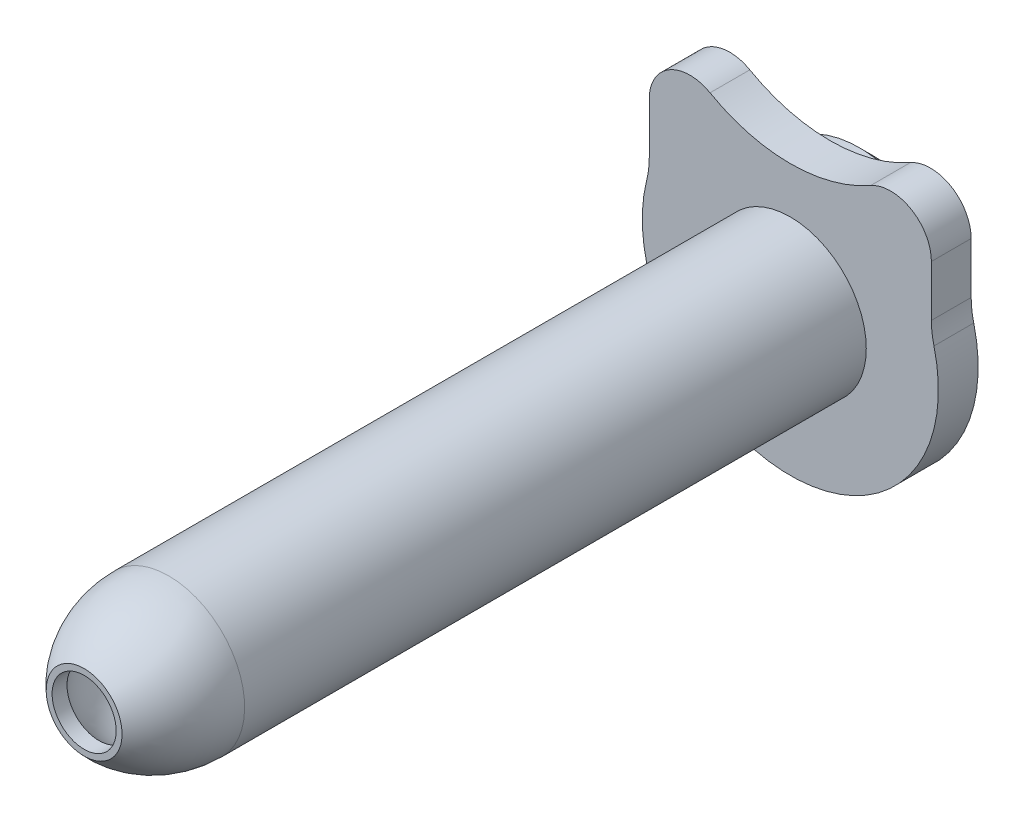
ISO-10303-21;
HEADER;
FILE_DESCRIPTION(('STEP AP214'),'2;1');
FILE_NAME('part.step','',(''),(''),'','','');
FILE_SCHEMA(('AUTOMOTIVE_DESIGN { 1 0 10303 214 1 1 1 1 }'));
ENDSEC;
DATA;
#1=APPLICATION_CONTEXT('core data for automotive mechanical design processes');
#2=APPLICATION_PROTOCOL_DEFINITION('international standard','automotive_design',2000,#1);
#3=PRODUCT_CONTEXT('',#1,'mechanical');
#4=PRODUCT('Part','Part','',(#3));
#5=PRODUCT_RELATED_PRODUCT_CATEGORY('part','',(#4));
#6=PRODUCT_DEFINITION_FORMATION('','',#4);
#7=PRODUCT_DEFINITION_CONTEXT('part definition',#1,'design');
#8=PRODUCT_DEFINITION('design','',#6,#7);
#9=PRODUCT_DEFINITION_SHAPE('','',#8);
#10=(LENGTH_UNIT() NAMED_UNIT(*) SI_UNIT(.MILLI.,.METRE.));
#11=(NAMED_UNIT(*) PLANE_ANGLE_UNIT() SI_UNIT($,.RADIAN.));
#12=(NAMED_UNIT(*) SI_UNIT($,.STERADIAN.) SOLID_ANGLE_UNIT());
#13=UNCERTAINTY_MEASURE_WITH_UNIT(LENGTH_MEASURE(1.E-05),#10,'distance_accuracy_value','');
#14=(GEOMETRIC_REPRESENTATION_CONTEXT(3) GLOBAL_UNCERTAINTY_ASSIGNED_CONTEXT((#13)) GLOBAL_UNIT_ASSIGNED_CONTEXT((#10,
#11,#12)) REPRESENTATION_CONTEXT('',''));
#15=CARTESIAN_POINT('',(0.,0.,0.));
#16=DIRECTION('',(0.,0.,1.));
#17=DIRECTION('',(1.,0.,0.));
#18=AXIS2_PLACEMENT_3D('',#15,#16,#17);
#19=CARTESIAN_POINT('',(0.,0.,39.5732));
#20=DIRECTION('',(0.,0.,-1.));
#21=DIRECTION('',(0.,1.,0.));
#22=AXIS2_PLACEMENT_3D('',#19,#20,#21);
#23=DEGENERATE_TOROIDAL_SURFACE('',#22,2.0828,5.5118,.F.);
#24=CARTESIAN_POINT('',(0.,0.,43.4848));
#25=DIRECTION('',(0.,0.,-1.));
#26=DIRECTION('',(0.,1.,0.));
#27=AXIS2_PLACEMENT_3D('',#24,#25,#26);
#28=CIRCLE('',#27,1.80041061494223);
#29=CARTESIAN_POINT('',(0.,1.80041061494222,43.4848));
#30=VERTEX_POINT('',#29);
#31=EDGE_CURVE('E159',#30,#30,#28,.T.);
#32=ORIENTED_EDGE('',*,*,#31,.F.);
#33=EDGE_LOOP('',(#32));
#34=FACE_BOUND('',#33,.T.);
#35=CARTESIAN_POINT('',(0.,0.,39.7002));
#36=DIRECTION('',(0.,0.,-1.));
#37=DIRECTION('',(0.,1.,0.));
#38=AXIS2_PLACEMENT_3D('',#35,#36,#37);
#39=CIRCLE('',#38,3.42753667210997);
#40=CARTESIAN_POINT('',(0.,3.42753667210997,39.7002));
#41=VERTEX_POINT('',#40);
#42=EDGE_CURVE('E34',#41,#41,#39,.F.);
#43=ORIENTED_EDGE('',*,*,#42,.F.);
#44=EDGE_LOOP('',(#43));
#45=FACE_BOUND('',#44,.T.);
#46=ADVANCED_FACE('F30',(#34,#45),#23,.T.);
#47=CARTESIAN_POINT('',(5.6388,6.05972488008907,2.413));
#48=DIRECTION('',(0.,0.,1.));
#49=DIRECTION('',(0.,-1.,0.));
#50=AXIS2_PLACEMENT_3D('',#47,#48,#49);
#51=PLANE('',#50);
#52=CARTESIAN_POINT('',(5.6388,6.05972488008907,2.413));
#53=DIRECTION('',(0.,0.,-1.));
#54=DIRECTION('',(0.,-1.,0.));
#55=AXIS2_PLACEMENT_3D('',#52,#53,#54);
#56=CIRCLE('',#55,2.286);
#57=CARTESIAN_POINT('',(4.51104,8.04817990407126,2.413));
#58=VERTEX_POINT('',#57);
#59=CARTESIAN_POINT('',(7.9248,6.05972488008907,2.413));
#60=VERTEX_POINT('',#59);
#61=EDGE_CURVE('E144',#58,#60,#56,.T.);
#62=ORIENTED_EDGE('',*,*,#61,.T.);
#63=DIRECTION('',(0.,-1.,0.));
#64=VECTOR('',#63,1.);
#65=CARTESIAN_POINT('',(7.9248,3.19295781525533,2.413));
#66=LINE('',#65,#64);
#67=CARTESIAN_POINT('',(7.9248,3.19295781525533,2.413));
#68=VERTEX_POINT('',#67);
#69=EDGE_CURVE('E92',#60,#68,#66,.T.);
#70=ORIENTED_EDGE('',*,*,#69,.T.);
#71=CARTESIAN_POINT('',(12.7508,3.19295781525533,2.413));
#72=DIRECTION('',(0.,0.,1.));
#73=DIRECTION('',(0.,-1.,0.));
#74=AXIS2_PLACEMENT_3D('',#71,#72,#73);
#75=CIRCLE('',#74,4.826);
#76=CARTESIAN_POINT('',(8.06934685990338,2.02066412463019,2.413));
#77=VERTEX_POINT('',#76);
#78=EDGE_CURVE('E405',#68,#77,#75,.T.);
#79=ORIENTED_EDGE('',*,*,#78,.T.);
#80=CARTESIAN_POINT('',(0.,0.,2.413));
#81=DIRECTION('',(0.,0.,-1.));
#82=DIRECTION('',(0.,1.,0.));
#83=AXIS2_PLACEMENT_3D('',#80,#81,#82);
#84=CIRCLE('',#83,8.3185);
#85=CARTESIAN_POINT('',(-8.06934685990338,2.02066412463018,2.413));
#86=VERTEX_POINT('',#85);
#87=EDGE_CURVE('E407',#77,#86,#84,.T.);
#88=ORIENTED_EDGE('',*,*,#87,.T.);
#89=CARTESIAN_POINT('',(-12.7508,3.19295781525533,2.413));
#90=DIRECTION('',(0.,0.,1.));
#91=DIRECTION('',(0.,-1.,0.));
#92=AXIS2_PLACEMENT_3D('',#89,#90,#91);
#93=CIRCLE('',#92,4.826);
#94=CARTESIAN_POINT('',(-7.9248,3.19295781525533,2.413));
#95=VERTEX_POINT('',#94);
#96=EDGE_CURVE('E112',#86,#95,#93,.T.);
#97=ORIENTED_EDGE('',*,*,#96,.T.);
#98=DIRECTION('',(0.,1.,0.));
#99=VECTOR('',#98,1.);
#100=CARTESIAN_POINT('',(-7.9248,6.05972488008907,2.413));
#101=LINE('',#100,#99);
#102=CARTESIAN_POINT('',(-7.9248,6.05972488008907,2.413));
#103=VERTEX_POINT('',#102);
#104=EDGE_CURVE('E105',#95,#103,#101,.T.);
#105=ORIENTED_EDGE('',*,*,#104,.T.);
#106=CARTESIAN_POINT('',(-5.6388,6.05972488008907,2.413));
#107=DIRECTION('',(0.,0.,-1.));
#108=DIRECTION('',(0.,1.,0.));
#109=AXIS2_PLACEMENT_3D('',#106,#107,#108);
#110=CIRCLE('',#109,2.286);
#111=CARTESIAN_POINT('',(-4.51104,8.04817990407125,2.413));
#112=VERTEX_POINT('',#111);
#113=EDGE_CURVE('E110',#103,#112,#110,.T.);
#114=ORIENTED_EDGE('',*,*,#113,.T.);
#115=CARTESIAN_POINT('',(0.,16.002,2.413));
#116=DIRECTION('',(0.,0.,1.));
#117=DIRECTION('',(0.,1.,0.));
#118=AXIS2_PLACEMENT_3D('',#115,#116,#117);
#119=CIRCLE('',#118,9.144);
#120=EDGE_CURVE('E48',#112,#58,#119,.T.);
#121=ORIENTED_EDGE('',*,*,#120,.T.);
#122=EDGE_LOOP('',(#62,#70,#79,#88,#97,#105,#114,#121));
#123=FACE_BOUND('',#122,.T.);
#124=CARTESIAN_POINT('',(0.,0.,2.413));
#125=DIRECTION('',(0.,0.,1.));
#126=DIRECTION('',(0.,-1.,0.));
#127=AXIS2_PLACEMENT_3D('',#124,#125,#126);
#128=CIRCLE('',#127,5.6896);
#129=CARTESIAN_POINT('',(0.,-5.6896,2.413));
#130=VERTEX_POINT('',#129);
#131=EDGE_CURVE('E163',#130,#130,#128,.F.);
#132=ORIENTED_EDGE('',*,*,#131,.F.);
#133=EDGE_LOOP('',(#132));
#134=FACE_BOUND('',#133,.T.);
#135=ADVANCED_FACE('F107',(#123,#134),#51,.F.);
#136=CARTESIAN_POINT('',(0.,0.,0.));
#137=DIRECTION('',(0.,0.,-1.));
#138=DIRECTION('',(0.,1.,0.));
#139=AXIS2_PLACEMENT_3D('',#136,#137,#138);
#140=CYLINDRICAL_SURFACE('',#139,4.2672);
#141=CARTESIAN_POINT('',(0.,0.,4.6482));
#142=DIRECTION('',(0.,0.,1.));
#143=DIRECTION('',(0.,-1.,0.));
#144=AXIS2_PLACEMENT_3D('',#141,#142,#143);
#145=CIRCLE('',#144,4.2672);
#146=CARTESIAN_POINT('',(0.,-4.2672,4.6482));
#147=VERTEX_POINT('',#146);
#148=EDGE_CURVE('E160',#147,#147,#145,.F.);
#149=ORIENTED_EDGE('',*,*,#148,.F.);
#150=EDGE_LOOP('',(#149));
#151=FACE_BOUND('',#150,.T.);
#152=CARTESIAN_POINT('',(0.,0.,39.5732));
#153=DIRECTION('',(0.,0.,-1.));
#154=DIRECTION('',(0.,1.,0.));
#155=AXIS2_PLACEMENT_3D('',#152,#153,#154);
#156=CIRCLE('',#155,4.2672);
#157=CARTESIAN_POINT('',(0.,4.2672,39.5732));
#158=VERTEX_POINT('',#157);
#159=EDGE_CURVE('E164',#158,#158,#156,.T.);
#160=ORIENTED_EDGE('',*,*,#159,.T.);
#161=EDGE_LOOP('',(#160));
#162=FACE_BOUND('',#161,.T.);
#163=ADVANCED_FACE('F205',(#151,#162),#140,.T.);
#164=CARTESIAN_POINT('',(0.,0.,39.5732));
#165=DIRECTION('',(0.,0.,-1.));
#166=DIRECTION('',(0.,1.,0.));
#167=AXIS2_PLACEMENT_3D('',#164,#165,#166);
#168=DEGENERATE_TOROIDAL_SURFACE('',#167,2.0828,6.35,.F.);
#169=CARTESIAN_POINT('',(0.,0.,44.323));
#170=DIRECTION('',(0.,0.,-1.));
#171=DIRECTION('',(0.,1.,0.));
#172=AXIS2_PLACEMENT_3D('',#169,#170,#171);
#173=CIRCLE('',#172,2.13168691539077);
#174=CARTESIAN_POINT('',(0.,2.13168691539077,44.323));
#175=VERTEX_POINT('',#174);
#176=EDGE_CURVE('E171',#175,#175,#173,.T.);
#177=ORIENTED_EDGE('',*,*,#176,.T.);
#178=EDGE_LOOP('',(#177));
#179=FACE_BOUND('',#178,.T.);
#180=ORIENTED_EDGE('',*,*,#159,.F.);
#181=EDGE_LOOP('',(#180));
#182=FACE_BOUND('',#181,.T.);
#183=ADVANCED_FACE('F216',(#179,#182),#168,.F.);
#184=CARTESIAN_POINT('',(0.,0.,44.323));
#185=DIRECTION('',(0.,0.,1.));
#186=DIRECTION('',(0.,-1.,0.));
#187=AXIS2_PLACEMENT_3D('',#184,#185,#186);
#188=PLANE('',#187);
#189=CARTESIAN_POINT('',(0.,0.,44.323));
#190=DIRECTION('',(0.,0.,1.));
#191=DIRECTION('',(0.,-1.,0.));
#192=AXIS2_PLACEMENT_3D('',#189,#190,#191);
#193=CIRCLE('',#192,1.80041061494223);
#194=CARTESIAN_POINT('',(0.,1.80041061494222,44.323));
#195=VERTEX_POINT('',#194);
#196=EDGE_CURVE('E167',#195,#195,#193,.T.);
#197=ORIENTED_EDGE('',*,*,#196,.F.);
#198=EDGE_LOOP('',(#197));
#199=FACE_BOUND('',#198,.T.);
#200=ORIENTED_EDGE('',*,*,#176,.F.);
#201=EDGE_LOOP('',(#200));
#202=FACE_BOUND('',#201,.T.);
#203=ADVANCED_FACE('F212',(#199,#202),#188,.T.);
#204=CARTESIAN_POINT('',(0.,0.,82.804));
#205=DIRECTION('',(0.,0.,-1.));
#206=DIRECTION('',(0.,1.,0.));
#207=AXIS2_PLACEMENT_3D('',#204,#205,#206);
#208=CYLINDRICAL_SURFACE('',#207,1.80041061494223);
#209=CARTESIAN_POINT('',(0.,1.80041061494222,44.323));
#210=CARTESIAN_POINT('',(0.,1.80041061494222,44.31426875));
#211=CARTESIAN_POINT('',(0.,1.80041061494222,44.3055375));
#212=CARTESIAN_POINT('',(0.,1.80041061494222,44.288075));
#213=CARTESIAN_POINT('',(0.,1.80041061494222,44.27934375));
#214=CARTESIAN_POINT('',(0.,1.80041061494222,44.26188125));
#215=CARTESIAN_POINT('',(0.,1.80041061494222,44.25315));
#216=CARTESIAN_POINT('',(0.,1.80041061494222,44.2356875));
#217=CARTESIAN_POINT('',(0.,1.80041061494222,44.22695625));
#218=CARTESIAN_POINT('',(0.,1.80041061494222,44.20949375));
#219=CARTESIAN_POINT('',(0.,1.80041061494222,44.2007625));
#220=CARTESIAN_POINT('',(0.,1.80041061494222,44.1833));
#221=CARTESIAN_POINT('',(0.,1.80041061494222,44.17456875));
#222=CARTESIAN_POINT('',(0.,1.80041061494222,44.15710625));
#223=CARTESIAN_POINT('',(0.,1.80041061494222,44.148375));
#224=CARTESIAN_POINT('',(0.,1.80041061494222,44.1309125));
#225=CARTESIAN_POINT('',(0.,1.80041061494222,44.12218125));
#226=CARTESIAN_POINT('',(0.,1.80041061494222,44.10471875));
#227=CARTESIAN_POINT('',(0.,1.80041061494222,44.0959875));
#228=CARTESIAN_POINT('',(0.,1.80041061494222,44.078525));
#229=CARTESIAN_POINT('',(0.,1.80041061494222,44.06979375));
#230=CARTESIAN_POINT('',(0.,1.80041061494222,44.05233125));
#231=CARTESIAN_POINT('',(0.,1.80041061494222,44.0436));
#232=CARTESIAN_POINT('',(0.,1.80041061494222,44.0261375));
#233=CARTESIAN_POINT('',(0.,1.80041061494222,44.01740625));
#234=CARTESIAN_POINT('',(0.,1.80041061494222,43.99994375));
#235=CARTESIAN_POINT('',(0.,1.80041061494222,43.9912125));
#236=CARTESIAN_POINT('',(0.,1.80041061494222,43.97375));
#237=CARTESIAN_POINT('',(0.,1.80041061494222,43.96501875));
#238=CARTESIAN_POINT('',(0.,1.80041061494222,43.94755625));
#239=CARTESIAN_POINT('',(0.,1.80041061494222,43.938825));
#240=CARTESIAN_POINT('',(0.,1.80041061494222,43.9213625));
#241=CARTESIAN_POINT('',(0.,1.80041061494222,43.91263125));
#242=CARTESIAN_POINT('',(0.,1.80041061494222,43.89516875));
#243=CARTESIAN_POINT('',(0.,1.80041061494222,43.8864375));
#244=CARTESIAN_POINT('',(0.,1.80041061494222,43.868975));
#245=CARTESIAN_POINT('',(0.,1.80041061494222,43.86024375));
#246=CARTESIAN_POINT('',(0.,1.80041061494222,43.84278125));
#247=CARTESIAN_POINT('',(0.,1.80041061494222,43.83405));
#248=CARTESIAN_POINT('',(0.,1.80041061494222,43.8165875));
#249=CARTESIAN_POINT('',(0.,1.80041061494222,43.80785625));
#250=CARTESIAN_POINT('',(0.,1.80041061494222,43.79039375));
#251=CARTESIAN_POINT('',(0.,1.80041061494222,43.7816625));
#252=CARTESIAN_POINT('',(0.,1.80041061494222,43.7642));
#253=CARTESIAN_POINT('',(0.,1.80041061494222,43.75546875));
#254=CARTESIAN_POINT('',(0.,1.80041061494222,43.73800625));
#255=CARTESIAN_POINT('',(0.,1.80041061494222,43.729275));
#256=CARTESIAN_POINT('',(0.,1.80041061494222,43.7118125));
#257=CARTESIAN_POINT('',(0.,1.80041061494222,43.70308125));
#258=CARTESIAN_POINT('',(0.,1.80041061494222,43.68561875));
#259=CARTESIAN_POINT('',(0.,1.80041061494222,43.6768875));
#260=CARTESIAN_POINT('',(0.,1.80041061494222,43.659425));
#261=CARTESIAN_POINT('',(0.,1.80041061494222,43.65069375));
#262=CARTESIAN_POINT('',(0.,1.80041061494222,43.63323125));
#263=CARTESIAN_POINT('',(0.,1.80041061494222,43.6245));
#264=CARTESIAN_POINT('',(0.,1.80041061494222,43.6070375));
#265=CARTESIAN_POINT('',(0.,1.80041061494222,43.59830625));
#266=CARTESIAN_POINT('',(0.,1.80041061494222,43.58084375));
#267=CARTESIAN_POINT('',(0.,1.80041061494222,43.5721125));
#268=CARTESIAN_POINT('',(0.,1.80041061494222,43.55465));
#269=CARTESIAN_POINT('',(0.,1.80041061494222,43.54591875));
#270=CARTESIAN_POINT('',(0.,1.80041061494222,43.52845625));
#271=CARTESIAN_POINT('',(0.,1.80041061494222,43.519725));
#272=CARTESIAN_POINT('',(0.,1.80041061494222,43.5022625));
#273=CARTESIAN_POINT('',(0.,1.80041061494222,43.49353125));
#274=CARTESIAN_POINT('',(0.,1.80041061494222,43.4848));
#275=B_SPLINE_CURVE_WITH_KNOTS('',3,(#209,#210,#211,#212,#213,#214,#215,#216,#217,#218,#219,
#220,#221,#222,#223,#224,#225,#226,#227,#228,#229,#230,#231,#232,#233,#234,#235,#236,#237,#238,
#239,#240,#241,#242,#243,#244,#245,#246,#247,#248,#249,#250,#251,#252,#253,#254,#255,#256,#257,
#258,#259,#260,#261,#262,#263,#264,#265,#266,#267,#268,#269,#270,#271,#272,#273,#274),
.UNSPECIFIED.,.F.,.F.,(4,2,2,2,2,2,2,2,2,2,2,2,2,2,2,2,2,2,2,2,2,2,2,2,2,2,2,2,2,2,2,2,4),(0.,
0.0261937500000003,0.0523875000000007,0.078581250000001,0.104775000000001,0.130968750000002,
0.157162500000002,0.183356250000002,0.209550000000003,0.235743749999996,0.261937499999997,
0.288131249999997,0.314324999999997,0.340518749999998,0.366712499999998,0.392906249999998,
0.419099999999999,0.445293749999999,0.471487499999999,0.49768125,0.523875,0.55006875,
0.576262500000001,0.602456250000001,0.628649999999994,0.654843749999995,0.681037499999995,
0.707231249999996,0.733424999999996,0.759618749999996,0.785812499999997,0.812006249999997,
0.838199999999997),.UNSPECIFIED.);
#276=EDGE_CURVE('BSEAM215',#195,#30,#275,.T.);
#277=ORIENTED_EDGE('',*,*,#196,.T.);
#278=ORIENTED_EDGE('',*,*,#31,.T.);
#279=ORIENTED_EDGE('',*,*,#276,.T.);
#280=ORIENTED_EDGE('',*,*,#276,.F.);
#281=EDGE_LOOP('',(#277,#279,#278,#280));
#282=FACE_BOUND('',#281,.T.);
#283=ADVANCED_FACE('F215',(#282),#208,.F.);
#284=CARTESIAN_POINT('',(5.6388,6.05972488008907,2.413));
#285=DIRECTION('',(0.,0.,1.));
#286=DIRECTION('',(0.,-1.,0.));
#287=AXIS2_PLACEMENT_3D('',#284,#285,#286);
#288=CYLINDRICAL_SURFACE('',#287,2.286);
#289=CARTESIAN_POINT('',(5.6388,6.05972488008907,4.6482));
#290=DIRECTION('',(0.,0.,-1.));
#291=DIRECTION('',(0.,-1.,0.));
#292=AXIS2_PLACEMENT_3D('',#289,#290,#291);
#293=CIRCLE('',#292,2.286);
#294=CARTESIAN_POINT('',(4.51104,8.04817990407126,4.6482));
#295=VERTEX_POINT('',#294);
#296=CARTESIAN_POINT('',(7.9248,6.05972488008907,4.6482));
#297=VERTEX_POINT('',#296);
#298=EDGE_CURVE('E130',#295,#297,#293,.T.);
#299=ORIENTED_EDGE('',*,*,#298,.T.);
#300=DIRECTION('',(0.,0.,1.));
#301=VECTOR('',#300,1.);
#302=CARTESIAN_POINT('',(7.9248,6.05972488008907,2.413));
#303=LINE('',#302,#301);
#304=EDGE_CURVE('E157',#60,#297,#303,.T.);
#305=ORIENTED_EDGE('',*,*,#304,.F.);
#306=ORIENTED_EDGE('',*,*,#61,.F.);
#307=DIRECTION('',(0.,0.,1.));
#308=VECTOR('',#307,1.);
#309=CARTESIAN_POINT('',(4.51104,8.04817990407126,2.413));
#310=LINE('',#309,#308);
#311=EDGE_CURVE('E126',#58,#295,#310,.T.);
#312=ORIENTED_EDGE('',*,*,#311,.T.);
#313=EDGE_LOOP('',(#299,#305,#306,#312));
#314=FACE_BOUND('',#313,.T.);
#315=ADVANCED_FACE('F239',(#314),#288,.T.);
#316=CARTESIAN_POINT('',(7.9248,3.19295781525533,2.413));
#317=DIRECTION('',(-1.,0.,0.));
#318=DIRECTION('',(0.,0.,1.));
#319=AXIS2_PLACEMENT_3D('',#316,#317,#318);
#320=PLANE('',#319);
#321=DIRECTION('',(0.,-1.,0.));
#322=VECTOR('',#321,1.);
#323=CARTESIAN_POINT('',(7.9248,3.19295781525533,4.6482));
#324=LINE('',#323,#322);
#325=CARTESIAN_POINT('',(7.9248,3.19295781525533,4.6482));
#326=VERTEX_POINT('',#325);
#327=EDGE_CURVE('E133',#297,#326,#324,.T.);
#328=ORIENTED_EDGE('',*,*,#327,.T.);
#329=DIRECTION('',(0.,0.,1.));
#330=VECTOR('',#329,1.);
#331=CARTESIAN_POINT('',(7.9248,3.19295781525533,2.413));
#332=LINE('',#331,#330);
#333=EDGE_CURVE('E154',#68,#326,#332,.T.);
#334=ORIENTED_EDGE('',*,*,#333,.F.);
#335=ORIENTED_EDGE('',*,*,#69,.F.);
#336=ORIENTED_EDGE('',*,*,#304,.T.);
#337=EDGE_LOOP('',(#328,#334,#335,#336));
#338=FACE_BOUND('',#337,.T.);
#339=ADVANCED_FACE('F261',(#338),#320,.F.);
#340=CARTESIAN_POINT('',(12.7508,3.19295781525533,2.413));
#341=DIRECTION('',(0.,0.,1.));
#342=DIRECTION('',(0.,-1.,0.));
#343=AXIS2_PLACEMENT_3D('',#340,#341,#342);
#344=CYLINDRICAL_SURFACE('',#343,4.826);
#345=CARTESIAN_POINT('',(12.7508,3.19295781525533,4.6482));
#346=DIRECTION('',(0.,0.,1.));
#347=DIRECTION('',(0.,-1.,0.));
#348=AXIS2_PLACEMENT_3D('',#345,#346,#347);
#349=CIRCLE('',#348,4.826);
#350=CARTESIAN_POINT('',(8.06934685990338,2.02066412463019,4.6482));
#351=VERTEX_POINT('',#350);
#352=EDGE_CURVE('E135',#326,#351,#349,.T.);
#353=ORIENTED_EDGE('',*,*,#352,.T.);
#354=DIRECTION('',(0.,0.,1.));
#355=VECTOR('',#354,1.);
#356=CARTESIAN_POINT('',(8.06934685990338,2.02066412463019,2.413));
#357=LINE('',#356,#355);
#358=EDGE_CURVE('E151',#77,#351,#357,.T.);
#359=ORIENTED_EDGE('',*,*,#358,.F.);
#360=ORIENTED_EDGE('',*,*,#78,.F.);
#361=ORIENTED_EDGE('',*,*,#333,.T.);
#362=EDGE_LOOP('',(#353,#359,#360,#361));
#363=FACE_BOUND('',#362,.T.);
#364=ADVANCED_FACE('F257',(#363),#344,.F.);
#365=CARTESIAN_POINT('',(0.,0.,2.413));
#366=DIRECTION('',(0.,0.,1.));
#367=DIRECTION('',(0.,-1.,0.));
#368=AXIS2_PLACEMENT_3D('',#365,#366,#367);
#369=CYLINDRICAL_SURFACE('',#368,8.3185);
#370=CARTESIAN_POINT('',(0.,0.,4.6482));
#371=DIRECTION('',(0.,0.,-1.));
#372=DIRECTION('',(0.,1.,0.));
#373=AXIS2_PLACEMENT_3D('',#370,#371,#372);
#374=CIRCLE('',#373,8.3185);
#375=CARTESIAN_POINT('',(-8.06934685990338,2.02066412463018,4.6482));
#376=VERTEX_POINT('',#375);
#377=EDGE_CURVE('E137',#351,#376,#374,.T.);
#378=ORIENTED_EDGE('',*,*,#377,.T.);
#379=DIRECTION('',(0.,0.,1.));
#380=VECTOR('',#379,1.);
#381=CARTESIAN_POINT('',(-8.06934685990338,2.02066412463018,2.413));
#382=LINE('',#381,#380);
#383=EDGE_CURVE('E148',#86,#376,#382,.T.);
#384=ORIENTED_EDGE('',*,*,#383,.F.);
#385=ORIENTED_EDGE('',*,*,#87,.F.);
#386=ORIENTED_EDGE('',*,*,#358,.T.);
#387=EDGE_LOOP('',(#378,#384,#385,#386));
#388=FACE_BOUND('',#387,.T.);
#389=ADVANCED_FACE('F253',(#388),#369,.T.);
#390=CARTESIAN_POINT('',(-12.7508,3.19295781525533,2.413));
#391=DIRECTION('',(0.,0.,1.));
#392=DIRECTION('',(0.,-1.,0.));
#393=AXIS2_PLACEMENT_3D('',#390,#391,#392);
#394=CYLINDRICAL_SURFACE('',#393,4.826);
#395=CARTESIAN_POINT('',(-12.7508,3.19295781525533,4.6482));
#396=DIRECTION('',(0.,0.,1.));
#397=DIRECTION('',(0.,-1.,0.));
#398=AXIS2_PLACEMENT_3D('',#395,#396,#397);
#399=CIRCLE('',#398,4.826);
#400=CARTESIAN_POINT('',(-7.9248,3.19295781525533,4.6482));
#401=VERTEX_POINT('',#400);
#402=EDGE_CURVE('E139',#376,#401,#399,.T.);
#403=ORIENTED_EDGE('',*,*,#402,.T.);
#404=DIRECTION('',(0.,0.,1.));
#405=VECTOR('',#404,1.);
#406=CARTESIAN_POINT('',(-7.9248,3.19295781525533,2.413));
#407=LINE('',#406,#405);
#408=EDGE_CURVE('E121',#95,#401,#407,.T.);
#409=ORIENTED_EDGE('',*,*,#408,.F.);
#410=ORIENTED_EDGE('',*,*,#96,.F.);
#411=ORIENTED_EDGE('',*,*,#383,.T.);
#412=EDGE_LOOP('',(#403,#409,#410,#411));
#413=FACE_BOUND('',#412,.T.);
#414=ADVANCED_FACE('F250',(#413),#394,.F.);
#415=CARTESIAN_POINT('',(-7.9248,6.05972488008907,2.413));
#416=DIRECTION('',(1.,0.,0.));
#417=DIRECTION('',(0.,0.,-1.));
#418=AXIS2_PLACEMENT_3D('',#415,#416,#417);
#419=PLANE('',#418);
#420=DIRECTION('',(0.,1.,0.));
#421=VECTOR('',#420,1.);
#422=CARTESIAN_POINT('',(-7.9248,6.05972488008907,4.6482));
#423=LINE('',#422,#421);
#424=CARTESIAN_POINT('',(-7.9248,6.05972488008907,4.6482));
#425=VERTEX_POINT('',#424);
#426=EDGE_CURVE('E120',#401,#425,#423,.T.);
#427=ORIENTED_EDGE('',*,*,#426,.T.);
#428=DIRECTION('',(0.,0.,1.));
#429=VECTOR('',#428,1.);
#430=CARTESIAN_POINT('',(-7.9248,6.05972488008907,2.413));
#431=LINE('',#430,#429);
#432=EDGE_CURVE('E117',#103,#425,#431,.T.);
#433=ORIENTED_EDGE('',*,*,#432,.F.);
#434=ORIENTED_EDGE('',*,*,#104,.F.);
#435=ORIENTED_EDGE('',*,*,#408,.T.);
#436=EDGE_LOOP('',(#427,#433,#434,#435));
#437=FACE_BOUND('',#436,.T.);
#438=ADVANCED_FACE('F118',(#437),#419,.F.);
#439=CARTESIAN_POINT('',(-5.6388,6.05972488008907,2.413));
#440=DIRECTION('',(0.,0.,1.));
#441=DIRECTION('',(0.,-1.,0.));
#442=AXIS2_PLACEMENT_3D('',#439,#440,#441);
#443=CYLINDRICAL_SURFACE('',#442,2.286);
#444=CARTESIAN_POINT('',(-5.6388,6.05972488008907,4.6482));
#445=DIRECTION('',(0.,0.,-1.));
#446=DIRECTION('',(0.,1.,0.));
#447=AXIS2_PLACEMENT_3D('',#444,#445,#446);
#448=CIRCLE('',#447,2.286);
#449=CARTESIAN_POINT('',(-4.51104,8.04817990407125,4.6482));
#450=VERTEX_POINT('',#449);
#451=EDGE_CURVE('E77',#425,#450,#448,.T.);
#452=ORIENTED_EDGE('',*,*,#451,.T.);
#453=DIRECTION('',(0.,0.,1.));
#454=VECTOR('',#453,1.);
#455=CARTESIAN_POINT('',(-4.51104,8.04817990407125,2.413));
#456=LINE('',#455,#454);
#457=EDGE_CURVE('E122',#112,#450,#456,.T.);
#458=ORIENTED_EDGE('',*,*,#457,.F.);
#459=ORIENTED_EDGE('',*,*,#113,.F.);
#460=ORIENTED_EDGE('',*,*,#432,.T.);
#461=EDGE_LOOP('',(#452,#458,#459,#460));
#462=FACE_BOUND('',#461,.T.);
#463=ADVANCED_FACE('F124',(#462),#443,.T.);
#464=CARTESIAN_POINT('',(0.,16.002,2.413));
#465=DIRECTION('',(0.,0.,1.));
#466=DIRECTION('',(0.,-1.,0.));
#467=AXIS2_PLACEMENT_3D('',#464,#465,#466);
#468=CYLINDRICAL_SURFACE('',#467,9.144);
#469=CARTESIAN_POINT('',(0.,16.002,4.6482));
#470=DIRECTION('',(0.,0.,1.));
#471=DIRECTION('',(0.,1.,0.));
#472=AXIS2_PLACEMENT_3D('',#469,#470,#471);
#473=CIRCLE('',#472,9.144);
#474=EDGE_CURVE('E83',#450,#295,#473,.T.);
#475=ORIENTED_EDGE('',*,*,#474,.T.);
#476=ORIENTED_EDGE('',*,*,#311,.F.);
#477=ORIENTED_EDGE('',*,*,#120,.F.);
#478=ORIENTED_EDGE('',*,*,#457,.T.);
#479=EDGE_LOOP('',(#475,#476,#477,#478));
#480=FACE_BOUND('',#479,.T.);
#481=ADVANCED_FACE('F233',(#480),#468,.F.);
#482=CARTESIAN_POINT('',(5.6388,6.05972488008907,4.6482));
#483=DIRECTION('',(0.,0.,1.));
#484=DIRECTION('',(0.,-1.,0.));
#485=AXIS2_PLACEMENT_3D('',#482,#483,#484);
#486=PLANE('',#485);
#487=ORIENTED_EDGE('',*,*,#148,.T.);
#488=EDGE_LOOP('',(#487));
#489=FACE_BOUND('',#488,.T.);
#490=ORIENTED_EDGE('',*,*,#298,.F.);
#491=ORIENTED_EDGE('',*,*,#474,.F.);
#492=ORIENTED_EDGE('',*,*,#451,.F.);
#493=ORIENTED_EDGE('',*,*,#426,.F.);
#494=ORIENTED_EDGE('',*,*,#402,.F.);
#495=ORIENTED_EDGE('',*,*,#377,.F.);
#496=ORIENTED_EDGE('',*,*,#352,.F.);
#497=ORIENTED_EDGE('',*,*,#327,.F.);
#498=EDGE_LOOP('',(#490,#491,#492,#493,#494,#495,#496,#497));
#499=FACE_BOUND('',#498,.T.);
#500=ADVANCED_FACE('F230',(#489,#499),#486,.T.);
#501=CARTESIAN_POINT('',(0.,0.,11.7985293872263));
#502=DIRECTION('',(0.,0.,1.));
#503=DIRECTION('',(1.,0.,0.));
#504=AXIS2_PLACEMENT_3D('',#501,#502,#503);
#505=CYLINDRICAL_SURFACE('',#504,5.6896);
#506=CARTESIAN_POINT('',(0.,0.,0.762000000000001));
#507=DIRECTION('',(0.,0.,-1.));
#508=DIRECTION('',(-1.,0.,0.));
#509=AXIS2_PLACEMENT_3D('',#506,#507,#508);
#510=CIRCLE('',#509,5.6896);
#511=CARTESIAN_POINT('',(5.6896,0.,0.762000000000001));
#512=VERTEX_POINT('',#511);
#513=EDGE_CURVE('E40',#512,#512,#510,.F.);
#514=ORIENTED_EDGE('',*,*,#513,.T.);
#515=EDGE_LOOP('',(#514));
#516=FACE_BOUND('',#515,.T.);
#517=ORIENTED_EDGE('',*,*,#131,.T.);
#518=EDGE_LOOP('',(#517));
#519=FACE_BOUND('',#518,.T.);
#520=ADVANCED_FACE('F183',(#516,#519),#505,.T.);
#521=CARTESIAN_POINT('',(0.,4.2672,0.));
#522=DIRECTION('',(0.,0.,-1.));
#523=DIRECTION('',(0.,1.,0.));
#524=AXIS2_PLACEMENT_3D('',#521,#522,#523);
#525=PLANE('',#524);
#526=CARTESIAN_POINT('',(0.,0.,0.));
#527=DIRECTION('',(0.,0.,-1.));
#528=DIRECTION('',(0.,1.,0.));
#529=AXIS2_PLACEMENT_3D('',#526,#527,#528);
#530=CIRCLE('',#529,4.9276);
#531=CARTESIAN_POINT('',(4.9276,0.,0.));
#532=VERTEX_POINT('',#531);
#533=EDGE_CURVE('E11',#532,#532,#530,.T.);
#534=ORIENTED_EDGE('',*,*,#533,.T.);
#535=EDGE_LOOP('',(#534));
#536=FACE_BOUND('',#535,.T.);
#537=CARTESIAN_POINT('',(0.,0.,0.));
#538=DIRECTION('',(0.,0.,-1.));
#539=DIRECTION('',(0.,1.,0.));
#540=AXIS2_PLACEMENT_3D('',#537,#538,#539);
#541=CIRCLE('',#540,3.429);
#542=CARTESIAN_POINT('',(0.,3.429,0.));
#543=VERTEX_POINT('',#542);
#544=EDGE_CURVE('E168',#543,#543,#541,.T.);
#545=ORIENTED_EDGE('',*,*,#544,.F.);
#546=EDGE_LOOP('',(#545));
#547=FACE_BOUND('',#546,.T.);
#548=ADVANCED_FACE('F188',(#536,#547),#525,.T.);
#549=CARTESIAN_POINT('',(0.,0.,0.762000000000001));
#550=DIRECTION('',(0.,0.,1.));
#551=DIRECTION('',(1.,0.,0.));
#552=AXIS2_PLACEMENT_3D('',#549,#550,#551);
#553=CONICAL_SURFACE('',#552,5.6896,0.785398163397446);
#554=CARTESIAN_POINT('',(4.9276,0.,0.));
#555=CARTESIAN_POINT('',(4.9355375,0.,0.00793749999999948));
#556=CARTESIAN_POINT('',(4.943475,0.,0.0158749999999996));
#557=CARTESIAN_POINT('',(4.95935,0.,0.0317499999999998));
#558=CARTESIAN_POINT('',(4.9672875,0.,0.0396874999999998));
#559=CARTESIAN_POINT('',(4.9831625,0.,0.0555624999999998));
#560=CARTESIAN_POINT('',(4.9911,0.,0.0634999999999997));
#561=CARTESIAN_POINT('',(5.006975,0.,0.0793749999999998));
#562=CARTESIAN_POINT('',(5.0149125,0.,0.0873124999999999));
#563=CARTESIAN_POINT('',(5.0307875,0.,0.1031875));
#564=CARTESIAN_POINT('',(5.038725,0.,0.111125));
#565=CARTESIAN_POINT('',(5.0546,0.,0.127));
#566=CARTESIAN_POINT('',(5.0625375,0.,0.1349375));
#567=CARTESIAN_POINT('',(5.0784125,0.,0.1508125));
#568=CARTESIAN_POINT('',(5.08635,0.,0.15875));
#569=CARTESIAN_POINT('',(5.102225,0.,0.174625));
#570=CARTESIAN_POINT('',(5.1101625,0.,0.1825625));
#571=CARTESIAN_POINT('',(5.1260375,0.,0.1984375));
#572=CARTESIAN_POINT('',(5.133975,0.,0.206375));
#573=CARTESIAN_POINT('',(5.14985,0.,0.22225));
#574=CARTESIAN_POINT('',(5.1577875,0.,0.2301875));
#575=CARTESIAN_POINT('',(5.1736625,0.,0.2460625));
#576=CARTESIAN_POINT('',(5.1816,0.,0.254));
#577=CARTESIAN_POINT('',(5.197475,0.,0.269875));
#578=CARTESIAN_POINT('',(5.2054125,0.,0.2778125));
#579=CARTESIAN_POINT('',(5.2212875,0.,0.2936875));
#580=CARTESIAN_POINT('',(5.229225,0.,0.301625));
#581=CARTESIAN_POINT('',(5.2451,0.,0.3175));
#582=CARTESIAN_POINT('',(5.2530375,0.,0.3254375));
#583=CARTESIAN_POINT('',(5.2689125,0.,0.3413125));
#584=CARTESIAN_POINT('',(5.27685,0.,0.34925));
#585=CARTESIAN_POINT('',(5.292725,0.,0.365125));
#586=CARTESIAN_POINT('',(5.3006625,0.,0.3730625));
#587=CARTESIAN_POINT('',(5.3165375,0.,0.3889375));
#588=CARTESIAN_POINT('',(5.324475,0.,0.396875));
#589=CARTESIAN_POINT('',(5.34035,0.,0.41275));
#590=CARTESIAN_POINT('',(5.3482875,0.,0.4206875));
#591=CARTESIAN_POINT('',(5.3641625,0.,0.4365625));
#592=CARTESIAN_POINT('',(5.3721,0.,0.4445));
#593=CARTESIAN_POINT('',(5.387975,0.,0.460375));
#594=CARTESIAN_POINT('',(5.3959125,0.,0.4683125));
#595=CARTESIAN_POINT('',(5.4117875,0.,0.4841875));
#596=CARTESIAN_POINT('',(5.419725,0.,0.492125));
#597=CARTESIAN_POINT('',(5.4356,0.,0.508));
#598=CARTESIAN_POINT('',(5.4435375,0.,0.5159375));
#599=CARTESIAN_POINT('',(5.4594125,0.,0.5318125));
#600=CARTESIAN_POINT('',(5.46735,0.,0.53975));
#601=CARTESIAN_POINT('',(5.483225,0.,0.555625));
#602=CARTESIAN_POINT('',(5.4911625,0.,0.5635625));
#603=CARTESIAN_POINT('',(5.5070375,0.,0.5794375));
#604=CARTESIAN_POINT('',(5.514975,0.,0.587375));
#605=CARTESIAN_POINT('',(5.53085,0.,0.60325));
#606=CARTESIAN_POINT('',(5.5387875,0.,0.611187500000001));
#607=CARTESIAN_POINT('',(5.5546625,0.,0.6270625));
#608=CARTESIAN_POINT('',(5.5626,0.,0.635));
#609=CARTESIAN_POINT('',(5.578475,0.,0.650875));
#610=CARTESIAN_POINT('',(5.5864125,0.,0.658812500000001));
#611=CARTESIAN_POINT('',(5.6022875,0.,0.674687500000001));
#612=CARTESIAN_POINT('',(5.610225,0.,0.682625));
#613=CARTESIAN_POINT('',(5.6261,0.,0.6985));
#614=CARTESIAN_POINT('',(5.6340375,0.,0.706437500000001));
#615=CARTESIAN_POINT('',(5.6499125,0.,0.722312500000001));
#616=CARTESIAN_POINT('',(5.65785,0.,0.730250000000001));
#617=CARTESIAN_POINT('',(5.673725,0.,0.746125));
#618=CARTESIAN_POINT('',(5.6816625,0.,0.7540625));
#619=CARTESIAN_POINT('',(5.6896,0.,0.762000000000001));
#620=B_SPLINE_CURVE_WITH_KNOTS('',3,(#554,#555,#556,#557,#558,#559,#560,#561,#562,#563,#564,
#565,#566,#567,#568,#569,#570,#571,#572,#573,#574,#575,#576,#577,#578,#579,#580,#581,#582,#583,
#584,#585,#586,#587,#588,#589,#590,#591,#592,#593,#594,#595,#596,#597,#598,#599,#600,#601,#602,
#603,#604,#605,#606,#607,#608,#609,#610,#611,#612,#613,#614,#615,#616,#617,#618,#619),
.UNSPECIFIED.,.F.,.F.,(4,2,2,2,2,2,2,2,2,2,2,2,2,2,2,2,2,2,2,2,2,2,2,2,2,2,2,2,2,2,2,2,4),(0.,
0.0336759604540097,0.0673519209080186,0.101027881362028,0.134703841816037,0.168379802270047,
0.202055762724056,0.235731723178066,0.269407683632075,0.303083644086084,0.336759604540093,
0.370435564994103,0.404111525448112,0.437787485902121,0.471463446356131,0.50513940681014,
0.538815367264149,0.572491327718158,0.606167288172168,0.639843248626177,0.673519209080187,
0.707195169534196,0.740871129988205,0.774547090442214,0.808223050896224,0.841899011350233,
0.875574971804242,0.909250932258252,0.942926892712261,0.97660285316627,1.01027881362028,
1.04395477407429,1.0776307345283),.UNSPECIFIED.);
#621=EDGE_CURVE('BSEAM32',#532,#512,#620,.T.);
#622=ORIENTED_EDGE('',*,*,#533,.F.);
#623=ORIENTED_EDGE('',*,*,#513,.F.);
#624=ORIENTED_EDGE('',*,*,#621,.T.);
#625=ORIENTED_EDGE('',*,*,#621,.F.);
#626=EDGE_LOOP('',(#622,#624,#623,#625));
#627=FACE_BOUND('',#626,.T.);
#628=ADVANCED_FACE('F32',(#627),#553,.T.);
#629=CARTESIAN_POINT('',(0.,0.,39.7002));
#630=DIRECTION('',(0.,0.,-1.));
#631=DIRECTION('',(0.,1.,0.));
#632=AXIS2_PLACEMENT_3D('',#629,#630,#631);
#633=PLANE('',#632);
#634=CARTESIAN_POINT('',(0.,0.,39.7002));
#635=DIRECTION('',(0.,0.,-1.));
#636=DIRECTION('',(0.,1.,0.));
#637=AXIS2_PLACEMENT_3D('',#634,#635,#636);
#638=CIRCLE('',#637,3.429);
#639=CARTESIAN_POINT('',(0.,3.429,39.7002));
#640=VERTEX_POINT('',#639);
#641=EDGE_CURVE('E397',#640,#640,#638,.T.);
#642=ORIENTED_EDGE('',*,*,#641,.T.);
#643=EDGE_LOOP('',(#642));
#644=FACE_BOUND('',#643,.T.);
#645=ORIENTED_EDGE('',*,*,#42,.T.);
#646=EDGE_LOOP('',(#645));
#647=FACE_BOUND('',#646,.T.);
#648=ADVANCED_FACE('F187',(#644,#647),#633,.T.);
#649=CARTESIAN_POINT('',(0.,0.,0.));
#650=DIRECTION('',(0.,0.,-1.));
#651=DIRECTION('',(0.,1.,0.));
#652=AXIS2_PLACEMENT_3D('',#649,#650,#651);
#653=CYLINDRICAL_SURFACE('',#652,3.429);
#654=ORIENTED_EDGE('',*,*,#641,.F.);
#655=EDGE_LOOP('',(#654));
#656=FACE_BOUND('',#655,.T.);
#657=ORIENTED_EDGE('',*,*,#544,.T.);
#658=EDGE_LOOP('',(#657));
#659=FACE_BOUND('',#658,.T.);
#660=ADVANCED_FACE('F194',(#656,#659),#653,.F.);
#661=CLOSED_SHELL('',(#46,#135,#163,#183,#203,#283,#315,#339,#364,#389,#414,#438,#463,#481,#500,
#520,#548,#628,#648,#660));
#662=MANIFOLD_SOLID_BREP('B2',#661);
#663=ADVANCED_BREP_SHAPE_REPRESENTATION('',(#18,#662),#14);
#664=SHAPE_DEFINITION_REPRESENTATION(#9,#663);
ENDSEC;
END-ISO-10303-21;
